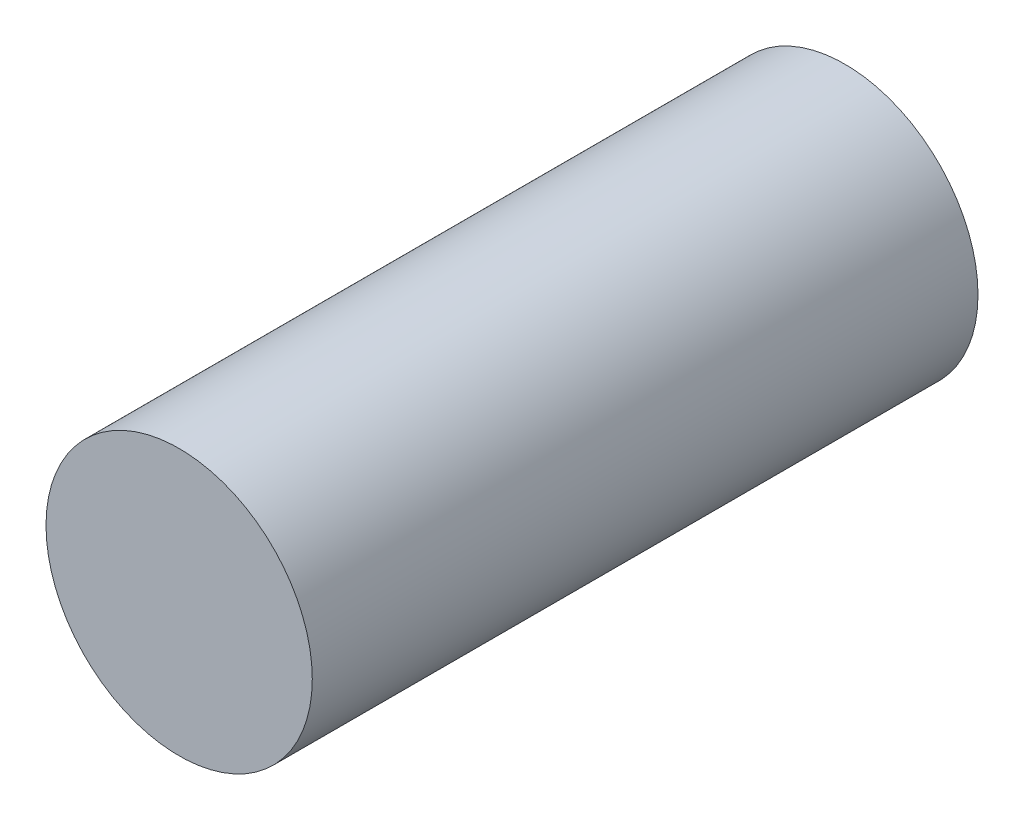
ISO-10303-21;
HEADER;
FILE_DESCRIPTION(('STEP AP214'),'2;1');
FILE_NAME('part.step','',(''),(''),'','','');
FILE_SCHEMA(('AUTOMOTIVE_DESIGN { 1 0 10303 214 1 1 1 1 }'));
ENDSEC;
DATA;
#1=APPLICATION_CONTEXT('core data for automotive mechanical design processes');
#2=APPLICATION_PROTOCOL_DEFINITION('international standard','automotive_design',2000,#1);
#3=PRODUCT_CONTEXT('',#1,'mechanical');
#4=PRODUCT('Part','Part','',(#3));
#5=PRODUCT_RELATED_PRODUCT_CATEGORY('part','',(#4));
#6=PRODUCT_DEFINITION_FORMATION('','',#4);
#7=PRODUCT_DEFINITION_CONTEXT('part definition',#1,'design');
#8=PRODUCT_DEFINITION('design','',#6,#7);
#9=PRODUCT_DEFINITION_SHAPE('','',#8);
#10=(LENGTH_UNIT() NAMED_UNIT(*) SI_UNIT(.MILLI.,.METRE.));
#11=(NAMED_UNIT(*) PLANE_ANGLE_UNIT() SI_UNIT($,.RADIAN.));
#12=(NAMED_UNIT(*) SI_UNIT($,.STERADIAN.) SOLID_ANGLE_UNIT());
#13=UNCERTAINTY_MEASURE_WITH_UNIT(LENGTH_MEASURE(1.E-05),#10,'distance_accuracy_value','');
#14=(GEOMETRIC_REPRESENTATION_CONTEXT(3) GLOBAL_UNCERTAINTY_ASSIGNED_CONTEXT((#13)) GLOBAL_UNIT_ASSIGNED_CONTEXT((#10,
#11,#12)) REPRESENTATION_CONTEXT('',''));
#15=CARTESIAN_POINT('',(0.,0.,0.));
#16=DIRECTION('',(0.,0.,1.));
#17=DIRECTION('',(1.,0.,0.));
#18=AXIS2_PLACEMENT_3D('',#15,#16,#17);
#19=CARTESIAN_POINT('',(0.,0.,6.34999999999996));
#20=DIRECTION('',(0.,0.,-1.));
#21=DIRECTION('',(-1.,0.,0.));
#22=AXIS2_PLACEMENT_3D('',#19,#20,#21);
#23=CYLINDRICAL_SURFACE('',#22,1.27);
#24=CARTESIAN_POINT('',(0.,0.,6.34999999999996));
#25=DIRECTION('',(0.,0.,1.));
#26=DIRECTION('',(1.,0.,0.));
#27=AXIS2_PLACEMENT_3D('',#24,#25,#26);
#28=CIRCLE('',#27,1.27);
#29=CARTESIAN_POINT('',(1.27,0.,6.34999999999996));
#30=VERTEX_POINT('',#29);
#31=EDGE_CURVE('E10',#30,#30,#28,.T.);
#32=ORIENTED_EDGE('',*,*,#31,.F.);
#33=EDGE_LOOP('',(#32));
#34=FACE_BOUND('',#33,.T.);
#35=CARTESIAN_POINT('',(0.,0.,0.));
#36=DIRECTION('',(0.,0.,1.));
#37=DIRECTION('',(1.,0.,0.));
#38=AXIS2_PLACEMENT_3D('',#35,#36,#37);
#39=CIRCLE('',#38,1.27);
#40=CARTESIAN_POINT('',(1.27,0.,0.));
#41=VERTEX_POINT('',#40);
#42=EDGE_CURVE('E33',#41,#41,#39,.T.);
#43=ORIENTED_EDGE('',*,*,#42,.T.);
#44=EDGE_LOOP('',(#43));
#45=FACE_BOUND('',#44,.T.);
#46=ADVANCED_FACE('F30',(#34,#45),#23,.T.);
#47=CARTESIAN_POINT('',(0.,0.,6.34999999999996));
#48=DIRECTION('',(0.,0.,1.));
#49=DIRECTION('',(1.,0.,0.));
#50=AXIS2_PLACEMENT_3D('',#47,#48,#49);
#51=PLANE('',#50);
#52=ORIENTED_EDGE('',*,*,#31,.T.);
#53=EDGE_LOOP('',(#52));
#54=FACE_BOUND('',#53,.T.);
#55=ADVANCED_FACE('F45',(#54),#51,.T.);
#56=CARTESIAN_POINT('',(0.,0.,0.));
#57=DIRECTION('',(0.,0.,1.));
#58=DIRECTION('',(1.,0.,0.));
#59=AXIS2_PLACEMENT_3D('',#56,#57,#58);
#60=PLANE('',#59);
#61=ORIENTED_EDGE('',*,*,#42,.F.);
#62=EDGE_LOOP('',(#61));
#63=FACE_BOUND('',#62,.T.);
#64=ADVANCED_FACE('F43',(#63),#60,.F.);
#65=CLOSED_SHELL('',(#46,#55,#64));
#66=MANIFOLD_SOLID_BREP('B2',#65);
#67=ADVANCED_BREP_SHAPE_REPRESENTATION('',(#18,#66),#14);
#68=SHAPE_DEFINITION_REPRESENTATION(#9,#67);
ENDSEC;
END-ISO-10303-21;
